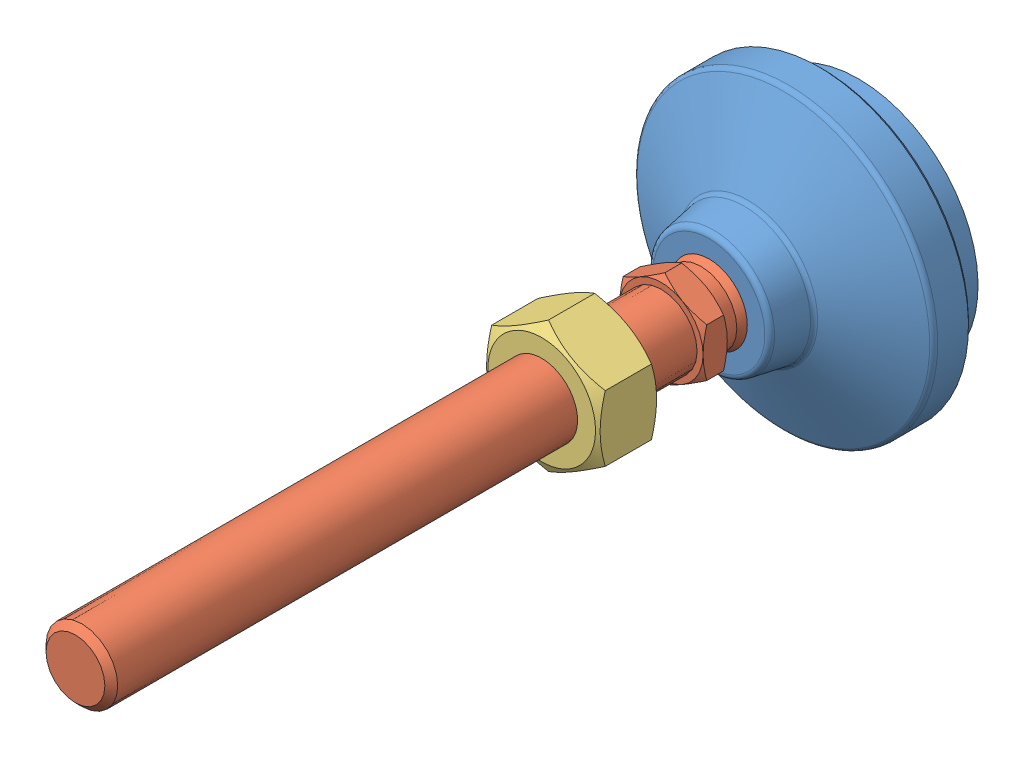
SolidWorks assembly LSVA40-M12X98-SUS.sldasm, configuration Default (file format 15000). Lengths in mm.
Overall size (50 50 131).
3 component instances, 3 part files, 0 mates.
Components (placement in the parent):
- LSVA40-M12X98-SUS_01-1: LSVA40-M12X98-SUS_01.sldprt [Default] at (0 0 6) x (1 0 0) z (0 -1 0) size (50 25 50)
- LSVA40-M12X98-SUS_02-1: LSVA40-M12X98-SUS_02.sldprt [Default] at (0 0 22.15) x (1 0 0) z (0 -1 0) size (14 115.85 16.17)
- LSVA40-M12X98-SUS_03-1: LSVA40-M12X98-SUS_03.sldprt [Default] at (0 0 43) size (19 21.94 10)
